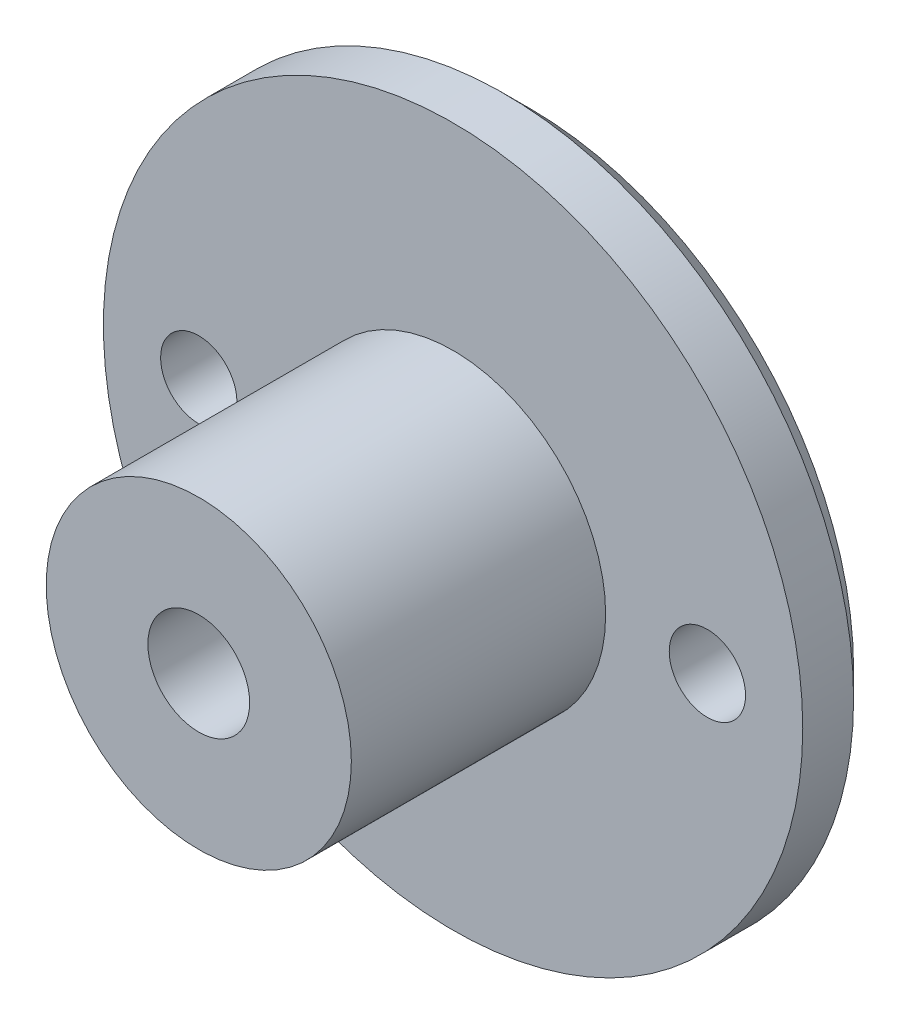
ISO-10303-21;
HEADER;
FILE_DESCRIPTION(('STEP AP214'),'2;1');
FILE_NAME('part.step','',(''),(''),'','','');
FILE_SCHEMA(('AUTOMOTIVE_DESIGN { 1 0 10303 214 1 1 1 1 }'));
ENDSEC;
DATA;
#1=APPLICATION_CONTEXT('core data for automotive mechanical design processes');
#2=APPLICATION_PROTOCOL_DEFINITION('international standard','automotive_design',2000,#1);
#3=PRODUCT_CONTEXT('',#1,'mechanical');
#4=PRODUCT('Part','Part','',(#3));
#5=PRODUCT_RELATED_PRODUCT_CATEGORY('part','',(#4));
#6=PRODUCT_DEFINITION_FORMATION('','',#4);
#7=PRODUCT_DEFINITION_CONTEXT('part definition',#1,'design');
#8=PRODUCT_DEFINITION('design','',#6,#7);
#9=PRODUCT_DEFINITION_SHAPE('','',#8);
#10=(LENGTH_UNIT() NAMED_UNIT(*) SI_UNIT(.MILLI.,.METRE.));
#11=(NAMED_UNIT(*) PLANE_ANGLE_UNIT() SI_UNIT($,.RADIAN.));
#12=(NAMED_UNIT(*) SI_UNIT($,.STERADIAN.) SOLID_ANGLE_UNIT());
#13=UNCERTAINTY_MEASURE_WITH_UNIT(LENGTH_MEASURE(1.E-05),#10,'distance_accuracy_value','');
#14=(GEOMETRIC_REPRESENTATION_CONTEXT(3) GLOBAL_UNCERTAINTY_ASSIGNED_CONTEXT((#13)) GLOBAL_UNIT_ASSIGNED_CONTEXT((#10,
#11,#12)) REPRESENTATION_CONTEXT('',''));
#15=CARTESIAN_POINT('',(0.,0.,0.));
#16=DIRECTION('',(0.,0.,1.));
#17=DIRECTION('',(1.,0.,0.));
#18=AXIS2_PLACEMENT_3D('',#15,#16,#17);
#19=CARTESIAN_POINT('',(0.,0.,3.));
#20=DIRECTION('',(0.,0.,-1.));
#21=DIRECTION('',(-1.,0.,0.));
#22=AXIS2_PLACEMENT_3D('',#19,#20,#21);
#23=CYLINDRICAL_SURFACE('',#22,13.75);
#24=CARTESIAN_POINT('',(0.,0.,1.));
#25=DIRECTION('',(0.,0.,1.));
#26=DIRECTION('',(1.,0.,0.));
#27=AXIS2_PLACEMENT_3D('',#24,#25,#26);
#28=CIRCLE('',#27,13.75);
#29=CARTESIAN_POINT('',(13.75,0.,1.));
#30=VERTEX_POINT('',#29);
#31=EDGE_CURVE('E39',#30,#30,#28,.T.);
#32=ORIENTED_EDGE('',*,*,#31,.T.);
#33=EDGE_LOOP('',(#32));
#34=FACE_BOUND('',#33,.T.);
#35=CARTESIAN_POINT('',(0.,0.,3.));
#36=DIRECTION('',(0.,0.,1.));
#37=DIRECTION('',(1.,0.,0.));
#38=AXIS2_PLACEMENT_3D('',#35,#36,#37);
#39=CIRCLE('',#38,13.75);
#40=CARTESIAN_POINT('',(13.75,0.,3.));
#41=VERTEX_POINT('',#40);
#42=EDGE_CURVE('E43',#41,#41,#39,.T.);
#43=ORIENTED_EDGE('',*,*,#42,.F.);
#44=EDGE_LOOP('',(#43));
#45=FACE_BOUND('',#44,.T.);
#46=ADVANCED_FACE('F32',(#34,#45),#23,.T.);
#47=CARTESIAN_POINT('',(0.,0.,3.));
#48=DIRECTION('',(0.,0.,1.));
#49=DIRECTION('',(1.,0.,0.));
#50=AXIS2_PLACEMENT_3D('',#47,#48,#49);
#51=PLANE('',#50);
#52=CARTESIAN_POINT('',(-10.,0.,3.));
#53=DIRECTION('',(0.,0.,1.));
#54=DIRECTION('',(1.,0.,0.));
#55=AXIS2_PLACEMENT_3D('',#52,#53,#54);
#56=CIRCLE('',#55,1.5);
#57=CARTESIAN_POINT('',(-8.5,0.,3.));
#58=VERTEX_POINT('',#57);
#59=EDGE_CURVE('E67',#58,#58,#56,.T.);
#60=ORIENTED_EDGE('',*,*,#59,.F.);
#61=EDGE_LOOP('',(#60));
#62=FACE_BOUND('',#61,.T.);
#63=CARTESIAN_POINT('',(10.,0.,3.));
#64=DIRECTION('',(0.,0.,1.));
#65=DIRECTION('',(1.,0.,0.));
#66=AXIS2_PLACEMENT_3D('',#63,#64,#65);
#67=CIRCLE('',#66,1.5);
#68=CARTESIAN_POINT('',(11.5,0.,3.));
#69=VERTEX_POINT('',#68);
#70=EDGE_CURVE('E61',#69,#69,#67,.T.);
#71=ORIENTED_EDGE('',*,*,#70,.F.);
#72=EDGE_LOOP('',(#71));
#73=FACE_BOUND('',#72,.T.);
#74=CARTESIAN_POINT('',(0.,0.,3.));
#75=DIRECTION('',(0.,0.,1.));
#76=DIRECTION('',(1.,0.,0.));
#77=AXIS2_PLACEMENT_3D('',#74,#75,#76);
#78=CIRCLE('',#77,6.);
#79=CARTESIAN_POINT('',(6.,0.,3.));
#80=VERTEX_POINT('',#79);
#81=EDGE_CURVE('E50',#80,#80,#78,.T.);
#82=ORIENTED_EDGE('',*,*,#81,.F.);
#83=EDGE_LOOP('',(#82));
#84=FACE_BOUND('',#83,.T.);
#85=ORIENTED_EDGE('',*,*,#42,.T.);
#86=EDGE_LOOP('',(#85));
#87=FACE_BOUND('',#86,.T.);
#88=ADVANCED_FACE('F81',(#62,#73,#84,#87),#51,.T.);
#89=CARTESIAN_POINT('',(0.,0.,0.));
#90=DIRECTION('',(0.,0.,1.));
#91=DIRECTION('',(1.,0.,0.));
#92=AXIS2_PLACEMENT_3D('',#89,#90,#91);
#93=PLANE('',#92);
#94=CARTESIAN_POINT('',(-10.,0.,0.));
#95=DIRECTION('',(0.,0.,-1.));
#96=DIRECTION('',(-1.,0.,0.));
#97=AXIS2_PLACEMENT_3D('',#94,#95,#96);
#98=CIRCLE('',#97,1.5);
#99=CARTESIAN_POINT('',(-11.5,0.,0.));
#100=VERTEX_POINT('',#99);
#101=EDGE_CURVE('E70',#100,#100,#98,.T.);
#102=ORIENTED_EDGE('',*,*,#101,.F.);
#103=EDGE_LOOP('',(#102));
#104=FACE_BOUND('',#103,.T.);
#105=CARTESIAN_POINT('',(10.,0.,0.));
#106=DIRECTION('',(0.,0.,-1.));
#107=DIRECTION('',(-1.,0.,0.));
#108=AXIS2_PLACEMENT_3D('',#105,#106,#107);
#109=CIRCLE('',#108,1.5);
#110=CARTESIAN_POINT('',(8.5,0.,0.));
#111=VERTEX_POINT('',#110);
#112=EDGE_CURVE('E64',#111,#111,#109,.T.);
#113=ORIENTED_EDGE('',*,*,#112,.F.);
#114=EDGE_LOOP('',(#113));
#115=FACE_BOUND('',#114,.T.);
#116=CARTESIAN_POINT('',(0.,0.,0.));
#117=DIRECTION('',(0.,0.,-1.));
#118=DIRECTION('',(-1.,0.,0.));
#119=AXIS2_PLACEMENT_3D('',#116,#117,#118);
#120=CIRCLE('',#119,2.);
#121=CARTESIAN_POINT('',(-2.,0.,0.));
#122=VERTEX_POINT('',#121);
#123=EDGE_CURVE('E58',#122,#122,#120,.T.);
#124=ORIENTED_EDGE('',*,*,#123,.F.);
#125=EDGE_LOOP('',(#124));
#126=FACE_BOUND('',#125,.T.);
#127=CARTESIAN_POINT('',(0.,0.,0.));
#128=DIRECTION('',(0.,0.,1.));
#129=DIRECTION('',(1.,0.,0.));
#130=AXIS2_PLACEMENT_3D('',#127,#128,#129);
#131=CIRCLE('',#130,12.75);
#132=CARTESIAN_POINT('',(12.75,0.,0.));
#133=VERTEX_POINT('',#132);
#134=EDGE_CURVE('E10',#133,#133,#131,.F.);
#135=ORIENTED_EDGE('',*,*,#134,.T.);
#136=EDGE_LOOP('',(#135));
#137=FACE_BOUND('',#136,.T.);
#138=ADVANCED_FACE('F77',(#104,#115,#126,#137),#93,.F.);
#139=CARTESIAN_POINT('',(0.,0.,13.));
#140=DIRECTION('',(0.,0.,-1.));
#141=DIRECTION('',(-1.,0.,0.));
#142=AXIS2_PLACEMENT_3D('',#139,#140,#141);
#143=CYLINDRICAL_SURFACE('',#142,6.);
#144=CARTESIAN_POINT('',(0.,0.,13.));
#145=DIRECTION('',(0.,0.,1.));
#146=DIRECTION('',(1.,0.,0.));
#147=AXIS2_PLACEMENT_3D('',#144,#145,#146);
#148=CIRCLE('',#147,6.);
#149=CARTESIAN_POINT('',(6.,0.,13.));
#150=VERTEX_POINT('',#149);
#151=EDGE_CURVE('E47',#150,#150,#148,.T.);
#152=ORIENTED_EDGE('',*,*,#151,.F.);
#153=EDGE_LOOP('',(#152));
#154=FACE_BOUND('',#153,.T.);
#155=ORIENTED_EDGE('',*,*,#81,.T.);
#156=EDGE_LOOP('',(#155));
#157=FACE_BOUND('',#156,.T.);
#158=ADVANCED_FACE('F80',(#154,#157),#143,.T.);
#159=CARTESIAN_POINT('',(0.,0.,13.));
#160=DIRECTION('',(0.,0.,1.));
#161=DIRECTION('',(1.,0.,0.));
#162=AXIS2_PLACEMENT_3D('',#159,#160,#161);
#163=PLANE('',#162);
#164=CARTESIAN_POINT('',(0.,0.,13.));
#165=DIRECTION('',(0.,0.,1.));
#166=DIRECTION('',(1.,0.,0.));
#167=AXIS2_PLACEMENT_3D('',#164,#165,#166);
#168=CIRCLE('',#167,2.);
#169=CARTESIAN_POINT('',(2.,0.,13.));
#170=VERTEX_POINT('',#169);
#171=EDGE_CURVE('E53',#170,#170,#168,.T.);
#172=ORIENTED_EDGE('',*,*,#171,.F.);
#173=EDGE_LOOP('',(#172));
#174=FACE_BOUND('',#173,.T.);
#175=ORIENTED_EDGE('',*,*,#151,.T.);
#176=EDGE_LOOP('',(#175));
#177=FACE_BOUND('',#176,.T.);
#178=ADVANCED_FACE('F94',(#174,#177),#163,.T.);
#179=CARTESIAN_POINT('',(0.,0.,1.));
#180=DIRECTION('',(0.,0.,1.));
#181=DIRECTION('',(1.,0.,0.));
#182=AXIS2_PLACEMENT_3D('',#179,#180,#181);
#183=CONICAL_SURFACE('',#182,13.75,0.78539816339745);
#184=ORIENTED_EDGE('',*,*,#134,.F.);
#185=EDGE_LOOP('',(#184));
#186=FACE_BOUND('',#185,.T.);
#187=ORIENTED_EDGE('',*,*,#31,.F.);
#188=EDGE_LOOP('',(#187));
#189=FACE_BOUND('',#188,.T.);
#190=ADVANCED_FACE('F34',(#186,#189),#183,.T.);
#191=CARTESIAN_POINT('',(0.,0.,0.));
#192=DIRECTION('',(0.,0.,-1.));
#193=DIRECTION('',(-1.,0.,0.));
#194=AXIS2_PLACEMENT_3D('',#191,#192,#193);
#195=CYLINDRICAL_SURFACE('',#194,2.);
#196=ORIENTED_EDGE('',*,*,#123,.T.);
#197=EDGE_LOOP('',(#196));
#198=FACE_BOUND('',#197,.T.);
#199=ORIENTED_EDGE('',*,*,#171,.T.);
#200=EDGE_LOOP('',(#199));
#201=FACE_BOUND('',#200,.T.);
#202=ADVANCED_FACE('F87',(#198,#201),#195,.F.);
#203=CARTESIAN_POINT('',(10.,0.,0.));
#204=DIRECTION('',(0.,0.,-1.));
#205=DIRECTION('',(-1.,0.,0.));
#206=AXIS2_PLACEMENT_3D('',#203,#204,#205);
#207=CYLINDRICAL_SURFACE('',#206,1.5);
#208=ORIENTED_EDGE('',*,*,#112,.T.);
#209=EDGE_LOOP('',(#208));
#210=FACE_BOUND('',#209,.T.);
#211=ORIENTED_EDGE('',*,*,#70,.T.);
#212=EDGE_LOOP('',(#211));
#213=FACE_BOUND('',#212,.T.);
#214=ADVANCED_FACE('F90',(#210,#213),#207,.F.);
#215=CARTESIAN_POINT('',(-10.,0.,0.));
#216=DIRECTION('',(0.,0.,-1.));
#217=DIRECTION('',(-1.,0.,0.));
#218=AXIS2_PLACEMENT_3D('',#215,#216,#217);
#219=CYLINDRICAL_SURFACE('',#218,1.5);
#220=ORIENTED_EDGE('',*,*,#101,.T.);
#221=EDGE_LOOP('',(#220));
#222=FACE_BOUND('',#221,.T.);
#223=ORIENTED_EDGE('',*,*,#59,.T.);
#224=EDGE_LOOP('',(#223));
#225=FACE_BOUND('',#224,.T.);
#226=ADVANCED_FACE('F74',(#222,#225),#219,.F.);
#227=CLOSED_SHELL('',(#46,#88,#138,#158,#178,#190,#202,#214,#226));
#228=MANIFOLD_SOLID_BREP('B2',#227);
#229=ADVANCED_BREP_SHAPE_REPRESENTATION('',(#18,#228),#14);
#230=SHAPE_DEFINITION_REPRESENTATION(#9,#229);
ENDSEC;
END-ISO-10303-21;
